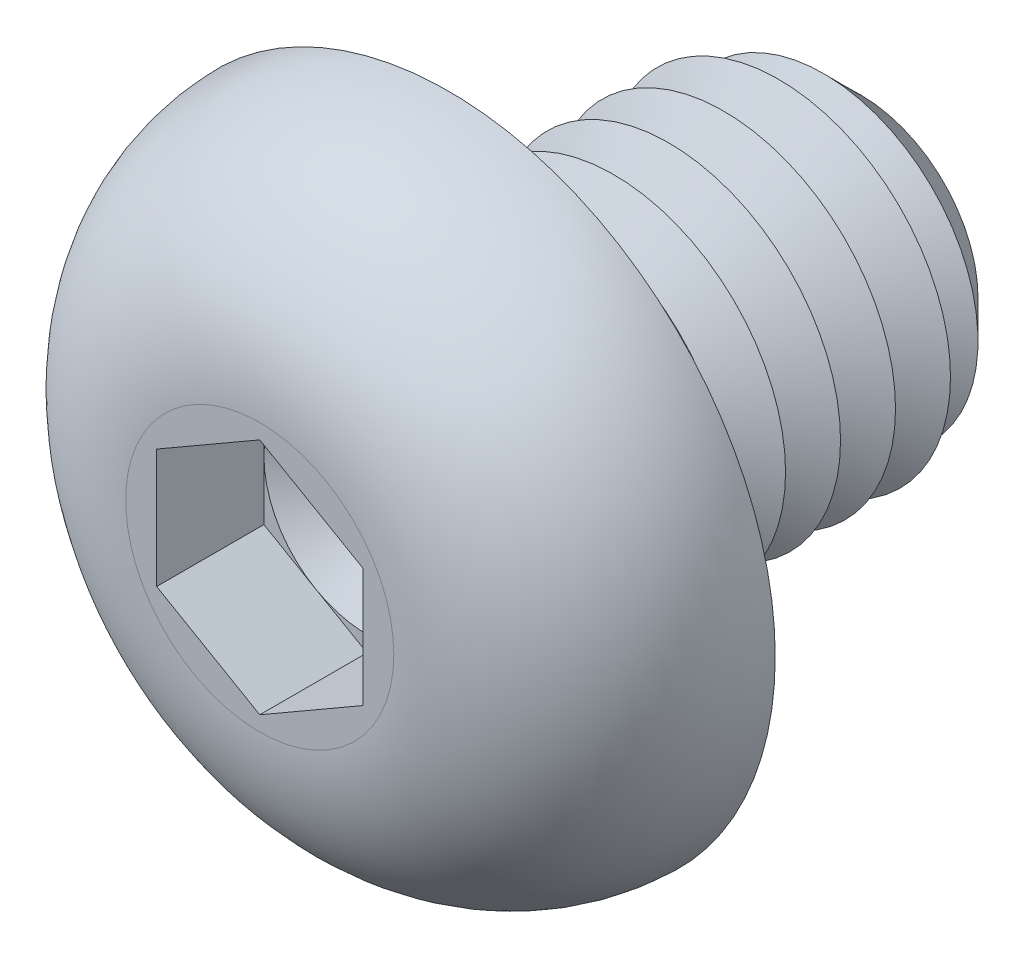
from build123d import *

# Parameters (mm, degrees)
CUT_EXTRUDE1_DEPTH  = 1.56
SKETCH4_R           = 2.5
BOSS_EXTRUDE1_DEPTH = 6
CHAMFER1_SIZE       = 0.8
LPATTERN1_COUNT     = 6
LPATTERN1_PITCH     = 0.8
FILLET2_R           = 0.4


with BuildPart() as part:
    # Sketch2 → Revolve1 (revolve)
    with BuildSketch(Plane(origin=(0, 0, 0), x_dir=(0, 0, -1), z_dir=(1, 0, 0)), mode=Mode.PRIVATE) as revolve1_sk:
        with BuildLine():
            Line((0, 0), (-2.75, 0))
            Line((-2.75, 0), (-2.75, 1.950446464))
            ThreePointArc((-2.75, 1.950446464), (-1.947498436, 3.912588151), (0, 4.75))
            Line((0, 4.75), (0, 0))
        make_face()
    revolve(revolve1_sk.sketch.rotate(Axis((0, 0, 47.934239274), (0, 0, -1)), 90), axis=Axis((0, 0, 47.934239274), (0, 0, -1)))

    # Sketch3 → Cut-Extrude1 (cut)
    with BuildSketch(Plane.XY.offset(2.75)):
        Polygon((0, 1.732050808), (-1.5, 0.866025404), (-1.5, -0.866025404), (0, -1.732050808), (1.5, -0.866025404), (1.5, 0.866025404), align=None)
    extrude(amount=-CUT_EXTRUDE1_DEPTH, mode=Mode.SUBTRACT)

    # Sketch4 → Boss-Extrude1 (add)
    with BuildSketch(Plane(origin=(0, 0, 0), x_dir=(-1, 0, 0), z_dir=(0, 0, -1))):
        with Locations(Location((0, 0, 0), (0, 0, 180))):
            Circle(SKETCH4_R)
    extrude(amount=BOSS_EXTRUDE1_DEPTH)

    # Chamfer1
    chamfer1_edges = [part.edges().sort_by_distance(p)[0] for p in [
        (-2.5, 0, -6),
    ]]
    chamfer(chamfer1_edges, length=CHAMFER1_SIZE)

    # Sketch5 → Cut-Revolve1 (revolve, cut)
    with BuildSketch(Plane(origin=(0, 0, 0), x_dir=(0, 0, -1), z_dir=(1, 0, 0)), mode=Mode.PRIVATE) as cut_revolve1_sk:
        Polygon((0.8, 2.5), (1.6, 2.5), (1.2, 1.807179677), align=None)
    cut_revolve1 = revolve(cut_revolve1_sk.sketch.rotate(Axis((0, 0, 47.934239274), (0, 0, -1)), 90), axis=Axis((0, 0, 47.934239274), (0, 0, -1)), mode=Mode.SUBTRACT)

    # LPattern1: Cut-Revolve1 ×6
    with Locations(*[(0, 0, -i * LPATTERN1_PITCH) for i in range(1, LPATTERN1_COUNT)]):
        add(cut_revolve1, mode=Mode.SUBTRACT)

    # Fillet2
    fillet2_edges = [part.edges().sort_by_distance(p)[0] for p in [
        (-2.5, 0, 0),
    ]]
    fillet(fillet2_edges, radius=FILLET2_R)

    # Cut-Extrude2 cone 1 section (on through the dimple's axis) → Cut-Extrude2 (revolve, cut)
    with BuildSketch(Plane(origin=(0, 0, 1.19), x_dir=(0, -1, 0), z_dir=(1, 0, 0))):
        Polygon((0, 0), (1.5, 0), (0, 0.866025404), align=None)
    revolve(axis=Axis((0, 0, 1.19), (0, 0, -1)), mode=Mode.SUBTRACT)


solid = part.part
